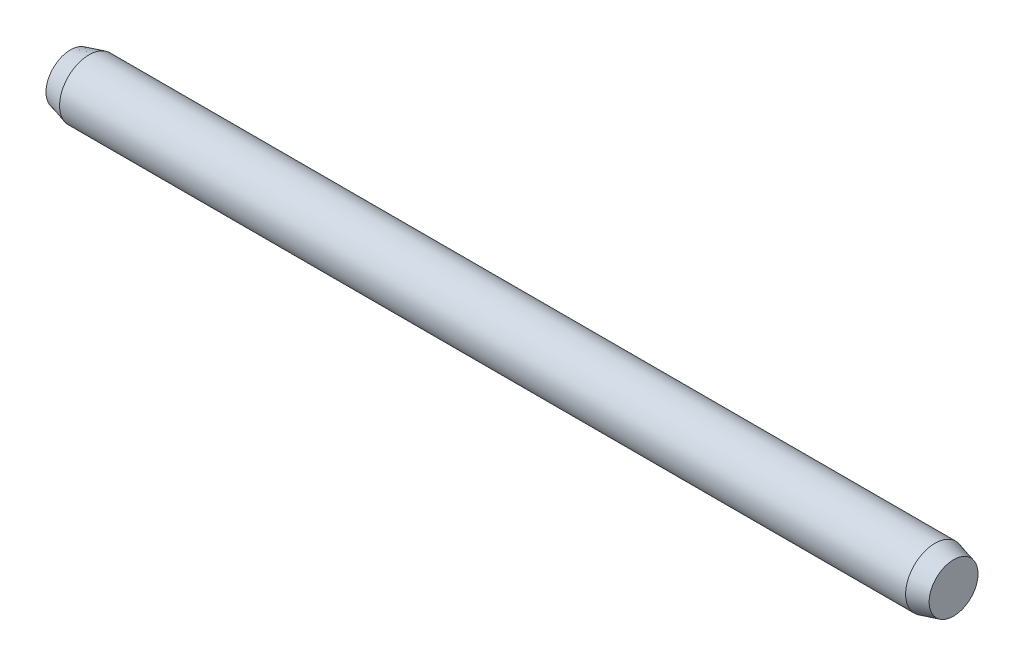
ISO-10303-21;
HEADER;
FILE_DESCRIPTION(('STEP AP214'),'2;1');
FILE_NAME('part.step','',(''),(''),'','','');
FILE_SCHEMA(('AUTOMOTIVE_DESIGN { 1 0 10303 214 1 1 1 1 }'));
ENDSEC;
DATA;
#1=APPLICATION_CONTEXT('core data for automotive mechanical design processes');
#2=APPLICATION_PROTOCOL_DEFINITION('international standard','automotive_design',2000,#1);
#3=PRODUCT_CONTEXT('',#1,'mechanical');
#4=PRODUCT('Part','Part','',(#3));
#5=PRODUCT_RELATED_PRODUCT_CATEGORY('part','',(#4));
#6=PRODUCT_DEFINITION_FORMATION('','',#4);
#7=PRODUCT_DEFINITION_CONTEXT('part definition',#1,'design');
#8=PRODUCT_DEFINITION('design','',#6,#7);
#9=PRODUCT_DEFINITION_SHAPE('','',#8);
#10=(LENGTH_UNIT() NAMED_UNIT(*) SI_UNIT(.MILLI.,.METRE.));
#11=(NAMED_UNIT(*) PLANE_ANGLE_UNIT() SI_UNIT($,.RADIAN.));
#12=(NAMED_UNIT(*) SI_UNIT($,.STERADIAN.) SOLID_ANGLE_UNIT());
#13=UNCERTAINTY_MEASURE_WITH_UNIT(LENGTH_MEASURE(1.E-05),#10,'distance_accuracy_value','');
#14=(GEOMETRIC_REPRESENTATION_CONTEXT(3) GLOBAL_UNCERTAINTY_ASSIGNED_CONTEXT((#13)) GLOBAL_UNIT_ASSIGNED_CONTEXT((#10,
#11,#12)) REPRESENTATION_CONTEXT('',''));
#15=CARTESIAN_POINT('',(0.,0.,0.));
#16=DIRECTION('',(0.,0.,1.));
#17=DIRECTION('',(1.,0.,0.));
#18=AXIS2_PLACEMENT_3D('',#15,#16,#17);
#19=CARTESIAN_POINT('',(0.,0.831192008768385,0.));
#20=DIRECTION('',(1.,0.,0.));
#21=DIRECTION('',(0.,0.,-1.));
#22=AXIS2_PLACEMENT_3D('',#19,#20,#21);
#23=PLANE('',#22);
#24=CARTESIAN_POINT('',(0.,0.,0.));
#25=DIRECTION('',(-1.,0.,0.));
#26=DIRECTION('',(0.,0.,1.));
#27=AXIS2_PLACEMENT_3D('',#24,#25,#26);
#28=CIRCLE('',#27,0.831192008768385);
#29=CARTESIAN_POINT('',(0.,0.,0.831192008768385));
#30=VERTEX_POINT('',#29);
#31=EDGE_CURVE('E10',#30,#30,#28,.T.);
#32=ORIENTED_EDGE('',*,*,#31,.T.);
#33=EDGE_LOOP('',(#32));
#34=FACE_BOUND('',#33,.T.);
#35=ADVANCED_FACE('F29',(#34),#23,.F.);
#36=CARTESIAN_POINT('',(0.629999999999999,0.,0.));
#37=DIRECTION('',(1.,0.,0.));
#38=DIRECTION('',(0.,0.,-1.));
#39=AXIS2_PLACEMENT_3D('',#36,#37,#38);
#40=CONICAL_SURFACE('',#39,0.999999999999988,0.261799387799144);
#41=ORIENTED_EDGE('',*,*,#31,.F.);
#42=EDGE_LOOP('',(#41));
#43=FACE_BOUND('',#42,.T.);
#44=CARTESIAN_POINT('',(0.629999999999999,0.,0.));
#45=DIRECTION('',(-1.,0.,0.));
#46=DIRECTION('',(0.,0.,1.));
#47=AXIS2_PLACEMENT_3D('',#44,#45,#46);
#48=CIRCLE('',#47,0.999999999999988);
#49=CARTESIAN_POINT('',(0.629999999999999,0.,0.999999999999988));
#50=VERTEX_POINT('',#49);
#51=EDGE_CURVE('E35',#50,#50,#48,.T.);
#52=ORIENTED_EDGE('',*,*,#51,.T.);
#53=EDGE_LOOP('',(#52));
#54=FACE_BOUND('',#53,.T.);
#55=ADVANCED_FACE('F61',(#43,#54),#40,.T.);
#56=CARTESIAN_POINT('',(-6.35,0.,0.));
#57=DIRECTION('',(-1.,0.,0.));
#58=DIRECTION('',(0.,0.,1.));
#59=AXIS2_PLACEMENT_3D('',#56,#57,#58);
#60=CYLINDRICAL_SURFACE('',#59,0.999999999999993);
#61=ORIENTED_EDGE('',*,*,#51,.F.);
#62=EDGE_LOOP('',(#61));
#63=FACE_BOUND('',#62,.T.);
#64=CARTESIAN_POINT('',(29.37,0.,0.));
#65=DIRECTION('',(-1.,0.,0.));
#66=DIRECTION('',(0.,0.,1.));
#67=AXIS2_PLACEMENT_3D('',#64,#65,#66);
#68=CIRCLE('',#67,0.999999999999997);
#69=CARTESIAN_POINT('',(29.37,0.,0.999999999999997));
#70=VERTEX_POINT('',#69);
#71=EDGE_CURVE('E39',#70,#70,#68,.T.);
#72=ORIENTED_EDGE('',*,*,#71,.T.);
#73=EDGE_LOOP('',(#72));
#74=FACE_BOUND('',#73,.T.);
#75=ADVANCED_FACE('F57',(#63,#74),#60,.T.);
#76=CARTESIAN_POINT('',(30.,0.,0.));
#77=DIRECTION('',(-1.,0.,0.));
#78=DIRECTION('',(0.,0.,1.));
#79=AXIS2_PLACEMENT_3D('',#76,#77,#78);
#80=CONICAL_SURFACE('',#79,0.83119200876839,0.26179938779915);
#81=ORIENTED_EDGE('',*,*,#71,.F.);
#82=EDGE_LOOP('',(#81));
#83=FACE_BOUND('',#82,.T.);
#84=CARTESIAN_POINT('',(30.,0.,0.));
#85=DIRECTION('',(-1.,0.,0.));
#86=DIRECTION('',(0.,0.,1.));
#87=AXIS2_PLACEMENT_3D('',#84,#85,#86);
#88=CIRCLE('',#87,0.83119200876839);
#89=CARTESIAN_POINT('',(30.,0.,0.83119200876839));
#90=VERTEX_POINT('',#89);
#91=EDGE_CURVE('E43',#90,#90,#88,.T.);
#92=ORIENTED_EDGE('',*,*,#91,.T.);
#93=EDGE_LOOP('',(#92));
#94=FACE_BOUND('',#93,.T.);
#95=ADVANCED_FACE('F49',(#83,#94),#80,.T.);
#96=CARTESIAN_POINT('',(30.,0.,0.));
#97=DIRECTION('',(-1.,0.,0.));
#98=DIRECTION('',(0.,0.,1.));
#99=AXIS2_PLACEMENT_3D('',#96,#97,#98);
#100=PLANE('',#99);
#101=ORIENTED_EDGE('',*,*,#91,.F.);
#102=EDGE_LOOP('',(#101));
#103=FACE_BOUND('',#102,.T.);
#104=ADVANCED_FACE('F51',(#103),#100,.F.);
#105=CLOSED_SHELL('',(#35,#55,#75,#95,#104));
#106=MANIFOLD_SOLID_BREP('B2',#105);
#107=ADVANCED_BREP_SHAPE_REPRESENTATION('',(#18,#106),#14);
#108=SHAPE_DEFINITION_REPRESENTATION(#9,#107);
ENDSEC;
END-ISO-10303-21;
